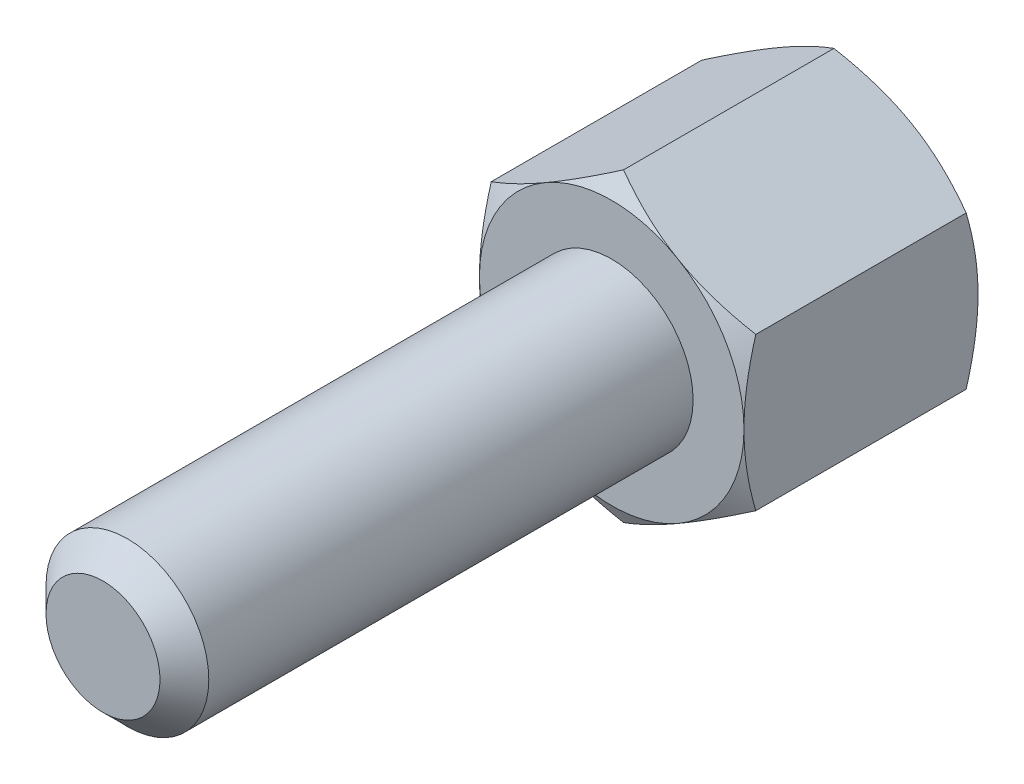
ISO-10303-21;
HEADER;
FILE_DESCRIPTION(('STEP AP214'),'2;1');
FILE_NAME('part.step','',(''),(''),'','','');
FILE_SCHEMA(('AUTOMOTIVE_DESIGN { 1 0 10303 214 1 1 1 1 }'));
ENDSEC;
DATA;
#1=APPLICATION_CONTEXT('core data for automotive mechanical design processes');
#2=APPLICATION_PROTOCOL_DEFINITION('international standard','automotive_design',2000,#1);
#3=PRODUCT_CONTEXT('',#1,'mechanical');
#4=PRODUCT('Part','Part','',(#3));
#5=PRODUCT_RELATED_PRODUCT_CATEGORY('part','',(#4));
#6=PRODUCT_DEFINITION_FORMATION('','',#4);
#7=PRODUCT_DEFINITION_CONTEXT('part definition',#1,'design');
#8=PRODUCT_DEFINITION('design','',#6,#7);
#9=PRODUCT_DEFINITION_SHAPE('','',#8);
#10=(LENGTH_UNIT() NAMED_UNIT(*) SI_UNIT(.MILLI.,.METRE.));
#11=(NAMED_UNIT(*) PLANE_ANGLE_UNIT() SI_UNIT($,.RADIAN.));
#12=(NAMED_UNIT(*) SI_UNIT($,.STERADIAN.) SOLID_ANGLE_UNIT());
#13=UNCERTAINTY_MEASURE_WITH_UNIT(LENGTH_MEASURE(1.E-05),#10,'distance_accuracy_value','');
#14=(GEOMETRIC_REPRESENTATION_CONTEXT(3) GLOBAL_UNCERTAINTY_ASSIGNED_CONTEXT((#13)) GLOBAL_UNIT_ASSIGNED_CONTEXT((#10,
#11,#12)) REPRESENTATION_CONTEXT('',''));
#15=CARTESIAN_POINT('',(0.,0.,0.));
#16=DIRECTION('',(0.,0.,1.));
#17=DIRECTION('',(1.,0.,0.));
#18=AXIS2_PLACEMENT_3D('',#15,#16,#17);
#19=CARTESIAN_POINT('',(0.,-7.50555349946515,28.));
#20=DIRECTION('',(-0.5,-0.866025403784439,0.));
#21=DIRECTION('',(-0.866025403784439,0.5,0.));
#22=AXIS2_PLACEMENT_3D('',#19,#20,#21);
#23=PLANE('',#22);
#24=DIRECTION('',(0.,0.,-1.));
#25=VECTOR('',#24,1.);
#26=CARTESIAN_POINT('',(-6.5,-3.75277674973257,28.));
#27=LINE('',#26,#25);
#28=CARTESIAN_POINT('',(-6.5,-3.75277674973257,12.4194434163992));
#29=VERTEX_POINT('',#28);
#30=CARTESIAN_POINT('',(-6.5,-3.75277674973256,2.08055658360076));
#31=VERTEX_POINT('',#30);
#32=EDGE_CURVE('E134',#29,#31,#27,.T.);
#33=ORIENTED_EDGE('',*,*,#32,.T.);
#34=CARTESIAN_POINT('',(-6.5002,-3.75266127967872,2.08062325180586));
#35=CARTESIAN_POINT('',(-6.35732254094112,-3.8351516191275,2.03300442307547));
#36=CARTESIAN_POINT('',(-6.21391236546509,-3.91794952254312,1.98754670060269));
#37=CARTESIAN_POINT('',(-5.92592736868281,-4.08421773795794,1.90154868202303));
#38=CARTESIAN_POINT('',(-5.78135207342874,-4.16768832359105,1.86101050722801));
#39=CARTESIAN_POINT('',(-5.34531134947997,-4.41943655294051,1.74757100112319));
#40=CARTESIAN_POINT('',(-5.05212471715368,-4.58870793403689,1.68304780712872));
#41=CARTESIAN_POINT('',(-4.61337625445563,-4.84201947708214,1.60738658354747));
#42=CARTESIAN_POINT('',(-4.46912536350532,-4.92530276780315,1.58583285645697));
#43=CARTESIAN_POINT('',(-4.17997178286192,-5.09224566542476,1.5496903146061));
#44=CARTESIAN_POINT('',(-4.03506915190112,-5.17590523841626,1.53510088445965));
#45=CARTESIAN_POINT('',(-3.74501222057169,-5.34336968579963,1.51325875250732));
#46=CARTESIAN_POINT('',(-3.5998583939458,-5.42717428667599,1.50599772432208));
#47=CARTESIAN_POINT('',(-3.30942466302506,-5.59485627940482,1.49896030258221));
#48=CARTESIAN_POINT('',(-3.16414476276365,-5.67873366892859,1.4991836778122));
#49=CARTESIAN_POINT('',(-2.76612405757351,-5.90853103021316,1.51008345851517));
#50=CARTESIAN_POINT('',(-2.51351353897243,-6.05437578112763,1.5283818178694));
#51=CARTESIAN_POINT('',(-2.00997032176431,-6.34509659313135,1.58640634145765));
#52=CARTESIAN_POINT('',(-1.7590393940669,-6.48997163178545,1.62615233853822));
#53=CARTESIAN_POINT('',(-1.25448277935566,-6.78127752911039,1.72550590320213));
#54=CARTESIAN_POINT('',(-1.00092075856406,-6.92767163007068,1.78553442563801));
#55=CARTESIAN_POINT('',(-0.497578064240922,-7.21827667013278,1.92177499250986));
#56=CARTESIAN_POINT('',(-0.247790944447,-7.3624913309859,1.99795503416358));
#57=CARTESIAN_POINT('',(0.000200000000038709,-7.50566896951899,2.08062325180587));
#58=B_SPLINE_CURVE_WITH_KNOTS('',3,(#34,#35,#36,#37,#38,#39,#40,#41,#42,#43,#44,#45,#46,#47,#48,
#49,#50,#51,#52,#53,#54,#55,#56,#57),.UNSPECIFIED.,.F.,.F.,(4,2,2,2,2,2,2,2,2,2,2,4),(0.,
0.515105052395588,1.03043143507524,2.06322554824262,2.56697389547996,3.07067772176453,
3.57380860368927,4.0769239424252,4.95279354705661,5.82947446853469,6.7255991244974,
7.61996451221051),.UNSPECIFIED.);
#59=CARTESIAN_POINT('',(-3.25,-5.62916512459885,1.5));
#60=VERTEX_POINT('',#59);
#61=EDGE_CURVE('E113',#31,#60,#58,.T.);
#62=ORIENTED_EDGE('',*,*,#61,.T.);
#63=CARTESIAN_POINT('',(0.,-7.50555349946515,2.08055658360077));
#64=VERTEX_POINT('',#63);
#65=EDGE_CURVE('E124',#60,#64,#58,.T.);
#66=ORIENTED_EDGE('',*,*,#65,.T.);
#67=DIRECTION('',(0.,0.,-1.));
#68=VECTOR('',#67,1.);
#69=CARTESIAN_POINT('',(0.,-7.50555349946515,28.));
#70=LINE('',#69,#68);
#71=CARTESIAN_POINT('',(0.,-7.50555349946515,12.4194434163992));
#72=VERTEX_POINT('',#71);
#73=EDGE_CURVE('E312',#72,#64,#70,.T.);
#74=ORIENTED_EDGE('',*,*,#73,.F.);
#75=CARTESIAN_POINT('',(0.000200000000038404,-7.50566896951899,12.4193767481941));
#76=CARTESIAN_POINT('',(-0.142677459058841,-7.42317863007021,12.4669955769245));
#77=CARTESIAN_POINT('',(-0.286087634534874,-7.34038072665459,12.5124532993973));
#78=CARTESIAN_POINT('',(-0.574072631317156,-7.17411251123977,12.5984513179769));
#79=CARTESIAN_POINT('',(-0.718647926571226,-7.09064192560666,12.638989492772));
#80=CARTESIAN_POINT('',(-1.15468865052,-6.8388936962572,12.7524289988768));
#81=CARTESIAN_POINT('',(-1.44787528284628,-6.66962231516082,12.8169521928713));
#82=CARTESIAN_POINT('',(-1.88662374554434,-6.41631077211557,12.8926134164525));
#83=CARTESIAN_POINT('',(-2.03087463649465,-6.33302748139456,12.914167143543));
#84=CARTESIAN_POINT('',(-2.32002821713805,-6.16608458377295,12.9503096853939));
#85=CARTESIAN_POINT('',(-2.46493084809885,-6.08242501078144,12.9648991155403));
#86=CARTESIAN_POINT('',(-2.75498777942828,-5.91496056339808,12.9867412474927));
#87=CARTESIAN_POINT('',(-2.90014160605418,-5.83115596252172,12.9940022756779));
#88=CARTESIAN_POINT('',(-3.19057533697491,-5.66347396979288,13.0010396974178));
#89=CARTESIAN_POINT('',(-3.33585523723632,-5.57959658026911,13.0008163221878));
#90=CARTESIAN_POINT('',(-3.73387594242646,-5.34979921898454,12.9899165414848));
#91=CARTESIAN_POINT('',(-3.98648646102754,-5.20395446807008,12.9716181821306));
#92=CARTESIAN_POINT('',(-4.49002967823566,-4.91323365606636,12.9135936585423));
#93=CARTESIAN_POINT('',(-4.74096060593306,-4.76835861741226,12.8738476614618));
#94=CARTESIAN_POINT('',(-5.24551722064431,-4.47705272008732,12.7744940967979));
#95=CARTESIAN_POINT('',(-5.4990792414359,-4.33065861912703,12.714465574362));
#96=CARTESIAN_POINT('',(-6.00242193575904,-4.04005357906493,12.5782250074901));
#97=CARTESIAN_POINT('',(-6.25220905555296,-3.89583891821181,12.5020449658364));
#98=CARTESIAN_POINT('',(-6.5002,-3.75266127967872,12.4193767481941));
#99=B_SPLINE_CURVE_WITH_KNOTS('',3,(#75,#76,#77,#78,#79,#80,#81,#82,#83,#84,#85,#86,#87,#88,#89,
#90,#91,#92,#93,#94,#95,#96,#97,#98),.UNSPECIFIED.,.F.,.F.,(4,2,2,2,2,2,2,2,2,2,2,4),(0.,
0.515105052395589,1.03043143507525,2.06322554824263,2.56697389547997,3.07067772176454,
3.57380860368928,4.07692394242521,4.95279354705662,5.82947446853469,6.7255991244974,
7.6199645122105),.UNSPECIFIED.);
#100=CARTESIAN_POINT('',(-3.25,-5.62916512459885,13.));
#101=VERTEX_POINT('',#100);
#102=EDGE_CURVE('E310',#72,#101,#99,.T.);
#103=ORIENTED_EDGE('',*,*,#102,.T.);
#104=EDGE_CURVE('E199',#101,#29,#99,.T.);
#105=ORIENTED_EDGE('',*,*,#104,.T.);
#106=EDGE_LOOP('',(#33,#62,#66,#74,#103,#105));
#107=FACE_BOUND('',#106,.T.);
#108=ADVANCED_FACE('F14',(#107),#23,.T.);
#109=CARTESIAN_POINT('',(-6.5,-3.75277674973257,28.));
#110=DIRECTION('',(-1.,0.,0.));
#111=DIRECTION('',(0.,0.,-1.));
#112=AXIS2_PLACEMENT_3D('',#109,#110,#111);
#113=PLANE('',#112);
#114=DIRECTION('',(0.,0.,-1.));
#115=VECTOR('',#114,1.);
#116=CARTESIAN_POINT('',(-6.5,3.75277674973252,28.));
#117=LINE('',#116,#115);
#118=CARTESIAN_POINT('',(-6.5,3.75277674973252,12.4194434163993));
#119=VERTEX_POINT('',#118);
#120=CARTESIAN_POINT('',(-6.5,3.75277674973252,2.08055658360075));
#121=VERTEX_POINT('',#120);
#122=EDGE_CURVE('E270',#119,#121,#117,.T.);
#123=ORIENTED_EDGE('',*,*,#122,.T.);
#124=CARTESIAN_POINT('',(-6.5,-10.0361922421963,4.650728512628));
#125=CARTESIAN_POINT('',(-6.5,-9.75266664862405,4.5133716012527));
#126=CARTESIAN_POINT('',(-6.5,-9.46848543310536,4.37734457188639));
#127=CARTESIAN_POINT('',(-6.5,-8.89846294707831,4.10869911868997));
#128=CARTESIAN_POINT('',(-6.5,-8.61262141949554,3.9760812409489));
#129=CARTESIAN_POINT('',(-6.5,-8.03743537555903,3.71432621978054));
#130=CARTESIAN_POINT('',(-6.5,-7.74808023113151,3.58521234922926));
#131=CARTESIAN_POINT('',(-6.5,-7.16705299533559,3.33232770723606));
#132=CARTESIAN_POINT('',(-6.5,-6.87538101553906,3.20855668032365));
#133=CARTESIAN_POINT('',(-6.5,-6.28000501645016,2.96396920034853));
#134=CARTESIAN_POINT('',(-6.5,-5.97621164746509,2.84336904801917));
#135=CARTESIAN_POINT('',(-6.5,-5.36505409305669,2.61140389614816));
#136=CARTESIAN_POINT('',(-6.5,-5.05768950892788,2.50003993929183));
#137=CARTESIAN_POINT('',(-6.5,-4.43949152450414,2.28950289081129));
#138=CARTESIAN_POINT('',(-6.5,-4.12866674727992,2.19030473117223));
#139=CARTESIAN_POINT('',(-6.5,-3.50255570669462,2.00731276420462));
#140=CARTESIAN_POINT('',(-6.5,-3.18727089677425,1.92351405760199));
#141=CARTESIAN_POINT('',(-6.5,-2.55382259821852,1.77581211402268));
#142=CARTESIAN_POINT('',(-6.5,-2.23568434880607,1.71180237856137));
#143=CARTESIAN_POINT('',(-6.5,-1.59545346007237,1.60734042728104));
#144=CARTESIAN_POINT('',(-6.5,-1.27336118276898,1.56688607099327));
#145=CARTESIAN_POINT('',(-6.5,-0.790676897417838,1.52655838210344));
#146=CARTESIAN_POINT('',(-6.5,-0.630894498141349,1.51650896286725));
#147=CARTESIAN_POINT('',(-6.5,-0.311040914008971,1.50316715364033));
#148=CARTESIAN_POINT('',(-6.5,-0.150969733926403,1.49987465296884));
#149=CARTESIAN_POINT('',(-6.5,0.169166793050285,1.50013270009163));
#150=CARTESIAN_POINT('',(-6.5,0.329232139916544,1.50368327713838));
#151=CARTESIAN_POINT('',(-6.5,0.649072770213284,1.51753943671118));
#152=CARTESIAN_POINT('',(-6.5,0.808848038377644,1.52784536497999));
#153=CARTESIAN_POINT('',(-6.5,1.19419727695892,1.56063200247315));
#154=CARTESIAN_POINT('',(-6.5,1.41949778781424,1.58639368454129));
#155=CARTESIAN_POINT('',(-6.5,1.86838679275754,1.64993426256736));
#156=CARTESIAN_POINT('',(-6.5,2.09197504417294,1.6877148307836));
#157=CARTESIAN_POINT('',(-6.5,2.75993879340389,1.81707817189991));
#158=CARTESIAN_POINT('',(-6.5,3.20125496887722,1.92465773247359));
#159=CARTESIAN_POINT('',(-6.5,3.86106261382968,2.11070306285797));
#160=CARTESIAN_POINT('',(-6.5,4.08298948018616,2.17768170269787));
#161=CARTESIAN_POINT('',(-6.5,4.5246869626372,2.31847007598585));
#162=CARTESIAN_POINT('',(-6.5,4.74445756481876,2.39227985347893));
#163=CARTESIAN_POINT('',(-6.5,5.18191389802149,2.54555675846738));
#164=CARTESIAN_POINT('',(-6.5,5.39960031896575,2.62502193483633));
#165=CARTESIAN_POINT('',(-6.5,5.83317828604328,2.78868722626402));
#166=CARTESIAN_POINT('',(-6.5,6.0490698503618,2.87288729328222));
#167=CARTESIAN_POINT('',(-6.5,6.54655902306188,3.07219706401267));
#168=CARTESIAN_POINT('',(-6.5,6.82758289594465,3.18873592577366));
#169=CARTESIAN_POINT('',(-6.5,7.3873338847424,3.42721915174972));
#170=CARTESIAN_POINT('',(-6.5,7.66606087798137,3.54916380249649));
#171=CARTESIAN_POINT('',(-6.5,8.22162486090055,3.79740709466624));
#172=CARTESIAN_POINT('',(-6.5,8.49846149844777,3.92370652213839));
#173=CARTESIAN_POINT('',(-6.5,9.05050907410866,4.17981565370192));
#174=CARTESIAN_POINT('',(-6.5,9.3257199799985,4.30962542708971));
#175=CARTESIAN_POINT('',(-6.5,9.87502028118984,4.57223340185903));
#176=CARTESIAN_POINT('',(-6.5,10.1491084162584,4.70503423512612));
#177=CARTESIAN_POINT('',(-6.5,10.6961211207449,4.97301305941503));
#178=CARTESIAN_POINT('',(-6.5,10.9690456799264,5.10819107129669));
#179=CARTESIAN_POINT('',(-6.5,11.786356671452,5.51668148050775));
#180=CARTESIAN_POINT('',(-6.5,12.3292689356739,5.7929447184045));
#181=CARTESIAN_POINT('',(-6.5,13.1197211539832,6.20032275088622));
#182=CARTESIAN_POINT('',(-6.5,13.3684032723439,6.32923529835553));
#183=CARTESIAN_POINT('',(-6.5,13.8652243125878,6.58809339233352));
#184=CARTESIAN_POINT('',(-6.5,14.1133632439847,6.71803892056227));
#185=CARTESIAN_POINT('',(-6.5,14.8570932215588,7.10922732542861));
#186=CARTESIAN_POINT('',(-6.5,15.3519783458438,7.37181214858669));
#187=CARTESIAN_POINT('',(-6.5,16.3391332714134,7.89910653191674));
#188=CARTESIAN_POINT('',(-6.5,16.8314064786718,8.1638097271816));
#189=CARTESIAN_POINT('',(-6.5,17.814752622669,8.69537673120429));
#190=CARTESIAN_POINT('',(-6.5,18.3058256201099,8.96224042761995));
#191=CARTESIAN_POINT('',(-6.5,18.7964531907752,9.22991533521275));
#192=B_SPLINE_CURVE_WITH_KNOTS('',3,(#124,#125,#126,#127,#128,#129,#130,#131,#132,#133,#134,
#135,#136,#137,#138,#139,#140,#141,#142,#143,#144,#145,#146,#147,#148,#149,#150,#151,#152,#153,
#154,#155,#156,#157,#158,#159,#160,#161,#162,#163,#164,#165,#166,#167,#168,#169,#170,#171,#172,
#173,#174,#175,#176,#177,#178,#179,#180,#181,#182,#183,#184,#185,#186,#187,#188,#189,#190,#191),
.UNSPECIFIED.,.F.,.F.,(4,2,2,2,2,2,2,2,2,2,2,2,2,2,2,2,2,2,2,2,2,2,2,2,2,2,2,2,2,2,2,2,2,4),(0.,
0.945148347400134,1.89044716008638,2.8409675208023,3.79144238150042,4.77189429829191,
5.75245674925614,6.73096350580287,7.7091584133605,8.68199344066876,9.65474005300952,
10.1349132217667,10.6150785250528,11.0952458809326,11.575437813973,12.2553584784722,
12.9353737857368,14.2961794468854,14.991564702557,15.6869544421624,16.3821054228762,
17.077249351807,17.9898636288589,18.9025263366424,19.815354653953,20.7282010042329,
21.6418846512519,22.5555763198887,24.3829978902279,25.2233250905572,26.0636374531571,
27.7443266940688,29.421105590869,31.0977978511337),.UNSPECIFIED.);
#193=CARTESIAN_POINT('',(-6.5,0.,1.5));
#194=VERTEX_POINT('',#193);
#195=EDGE_CURVE('E253',#121,#194,#192,.F.);
#196=ORIENTED_EDGE('',*,*,#195,.T.);
#197=EDGE_CURVE('E115',#194,#31,#192,.F.);
#198=ORIENTED_EDGE('',*,*,#197,.T.);
#199=ORIENTED_EDGE('',*,*,#32,.F.);
#200=CARTESIAN_POINT('',(-6.5,-10.0361922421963,9.84927148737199));
#201=CARTESIAN_POINT('',(-6.5,-9.75266664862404,9.98662839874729));
#202=CARTESIAN_POINT('',(-6.5,-9.46848543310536,10.1226554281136));
#203=CARTESIAN_POINT('',(-6.5,-8.89846294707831,10.39130088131));
#204=CARTESIAN_POINT('',(-6.5,-8.61262141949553,10.5239187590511));
#205=CARTESIAN_POINT('',(-6.5,-8.03743537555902,10.7856737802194));
#206=CARTESIAN_POINT('',(-6.5,-7.7480802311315,10.9147876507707));
#207=CARTESIAN_POINT('',(-6.5,-7.16705299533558,11.1676722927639));
#208=CARTESIAN_POINT('',(-6.5,-6.87538101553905,11.2914433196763));
#209=CARTESIAN_POINT('',(-6.5,-6.28000501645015,11.5360307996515));
#210=CARTESIAN_POINT('',(-6.5,-5.97621164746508,11.6566309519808));
#211=CARTESIAN_POINT('',(-6.5,-5.36505409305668,11.8885961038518));
#212=CARTESIAN_POINT('',(-6.5,-5.05768950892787,11.9999600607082));
#213=CARTESIAN_POINT('',(-6.5,-4.43949152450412,12.2104971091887));
#214=CARTESIAN_POINT('',(-6.5,-4.1286667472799,12.3096952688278));
#215=CARTESIAN_POINT('',(-6.5,-3.50255570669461,12.4926872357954));
#216=CARTESIAN_POINT('',(-6.5,-3.18727089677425,12.576485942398));
#217=CARTESIAN_POINT('',(-6.5,-2.55382259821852,12.7241878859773));
#218=CARTESIAN_POINT('',(-6.5,-2.23568434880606,12.7881976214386));
#219=CARTESIAN_POINT('',(-6.5,-1.59545346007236,12.8926595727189));
#220=CARTESIAN_POINT('',(-6.5,-1.27336118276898,12.9331139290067));
#221=CARTESIAN_POINT('',(-6.5,-0.790676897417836,12.9734416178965));
#222=CARTESIAN_POINT('',(-6.5,-0.630894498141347,12.9834910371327));
#223=CARTESIAN_POINT('',(-6.5,-0.311040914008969,12.9968328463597));
#224=CARTESIAN_POINT('',(-6.5,-0.1509697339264,13.0001253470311));
#225=CARTESIAN_POINT('',(-6.5,0.169166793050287,12.9998672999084));
#226=CARTESIAN_POINT('',(-6.5,0.329232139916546,12.9963167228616));
#227=CARTESIAN_POINT('',(-6.5,0.649072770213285,12.9824605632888));
#228=CARTESIAN_POINT('',(-6.5,0.808848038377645,12.97215463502));
#229=CARTESIAN_POINT('',(-6.5,1.19419727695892,12.9393679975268));
#230=CARTESIAN_POINT('',(-6.5,1.41949778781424,12.9136063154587));
#231=CARTESIAN_POINT('',(-6.5,1.86838679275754,12.8500657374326));
#232=CARTESIAN_POINT('',(-6.5,2.09197504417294,12.8122851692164));
#233=CARTESIAN_POINT('',(-6.5,2.75993879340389,12.6829218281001));
#234=CARTESIAN_POINT('',(-6.5,3.20125496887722,12.5753422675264));
#235=CARTESIAN_POINT('',(-6.5,3.86106261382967,12.389296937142));
#236=CARTESIAN_POINT('',(-6.5,4.08298948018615,12.3223182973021));
#237=CARTESIAN_POINT('',(-6.5,4.52468696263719,12.1815299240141));
#238=CARTESIAN_POINT('',(-6.5,4.74445756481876,12.1077201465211));
#239=CARTESIAN_POINT('',(-6.5,5.18191389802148,11.9544432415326));
#240=CARTESIAN_POINT('',(-6.5,5.39960031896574,11.8749780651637));
#241=CARTESIAN_POINT('',(-6.5,5.83317828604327,11.711312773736));
#242=CARTESIAN_POINT('',(-6.5,6.04906985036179,11.6271127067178));
#243=CARTESIAN_POINT('',(-6.5,6.54655902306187,11.4278029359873));
#244=CARTESIAN_POINT('',(-6.5,6.82758289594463,11.3112640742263));
#245=CARTESIAN_POINT('',(-6.5,7.38733388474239,11.0727808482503));
#246=CARTESIAN_POINT('',(-6.5,7.66606087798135,10.9508361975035));
#247=CARTESIAN_POINT('',(-6.5,8.22162486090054,10.7025929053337));
#248=CARTESIAN_POINT('',(-6.5,8.49846149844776,10.5762934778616));
#249=CARTESIAN_POINT('',(-6.5,9.05050907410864,10.3201843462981));
#250=CARTESIAN_POINT('',(-6.5,9.32571997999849,10.1903745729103));
#251=CARTESIAN_POINT('',(-6.5,9.87502028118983,9.92776659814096));
#252=CARTESIAN_POINT('',(-6.5,10.1491084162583,9.79496576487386));
#253=CARTESIAN_POINT('',(-6.5,10.6961211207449,9.52698694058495));
#254=CARTESIAN_POINT('',(-6.5,10.9690456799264,9.39180892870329));
#255=CARTESIAN_POINT('',(-6.5,11.786356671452,8.98331851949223));
#256=CARTESIAN_POINT('',(-6.5,12.3292689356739,8.70705528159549));
#257=CARTESIAN_POINT('',(-6.5,13.1197211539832,8.29967724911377));
#258=CARTESIAN_POINT('',(-6.5,13.3684032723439,8.17076470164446));
#259=CARTESIAN_POINT('',(-6.5,13.8652243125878,7.91190660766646));
#260=CARTESIAN_POINT('',(-6.5,14.1133632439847,7.78196107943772));
#261=CARTESIAN_POINT('',(-6.5,14.8570932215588,7.39077267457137));
#262=CARTESIAN_POINT('',(-6.5,15.3519783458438,7.1281878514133));
#263=CARTESIAN_POINT('',(-6.5,16.3391332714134,6.60089346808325));
#264=CARTESIAN_POINT('',(-6.5,16.8314064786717,6.33619027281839));
#265=CARTESIAN_POINT('',(-6.5,17.814752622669,5.8046232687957));
#266=CARTESIAN_POINT('',(-6.5,18.3058256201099,5.53775957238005));
#267=CARTESIAN_POINT('',(-6.5,18.7964531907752,5.27008466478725));
#268=B_SPLINE_CURVE_WITH_KNOTS('',3,(#200,#201,#202,#203,#204,#205,#206,#207,#208,#209,#210,
#211,#212,#213,#214,#215,#216,#217,#218,#219,#220,#221,#222,#223,#224,#225,#226,#227,#228,#229,
#230,#231,#232,#233,#234,#235,#236,#237,#238,#239,#240,#241,#242,#243,#244,#245,#246,#247,#248,
#249,#250,#251,#252,#253,#254,#255,#256,#257,#258,#259,#260,#261,#262,#263,#264,#265,#266,#267),
.UNSPECIFIED.,.F.,.F.,(4,2,2,2,2,2,2,2,2,2,2,2,2,2,2,2,2,2,2,2,2,2,2,2,2,2,2,2,2,2,2,2,2,4),(0.,
0.945148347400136,1.89044716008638,2.8409675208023,3.79144238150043,4.77189429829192,
5.75245674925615,6.73096350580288,7.70915841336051,8.68199344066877,9.65474005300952,
10.1349132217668,10.6150785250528,11.0952458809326,11.575437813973,12.2553584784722,
12.9353737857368,14.2961794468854,14.991564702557,15.6869544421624,16.3821054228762,
17.0772493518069,17.9898636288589,18.9025263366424,19.815354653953,20.7282010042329,
21.6418846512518,22.5555763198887,24.3829978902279,25.2233250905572,26.0636374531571,
27.7443266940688,29.421105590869,31.0977978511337),.UNSPECIFIED.);
#269=CARTESIAN_POINT('',(-6.5,0.,13.));
#270=VERTEX_POINT('',#269);
#271=EDGE_CURVE('E209',#29,#270,#268,.T.);
#272=ORIENTED_EDGE('',*,*,#271,.T.);
#273=EDGE_CURVE('E229',#270,#119,#268,.T.);
#274=ORIENTED_EDGE('',*,*,#273,.T.);
#275=EDGE_LOOP('',(#123,#196,#198,#199,#272,#274));
#276=FACE_BOUND('',#275,.T.);
#277=ADVANCED_FACE('F233',(#276),#113,.T.);
#278=CARTESIAN_POINT('',(0.,7.50555349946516,28.));
#279=DIRECTION('',(0.500000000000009,-0.866025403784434,0.));
#280=DIRECTION('',(-0.866025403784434,-0.500000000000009,0.));
#281=AXIS2_PLACEMENT_3D('',#278,#279,#280);
#282=PLANE('',#281);
#283=CARTESIAN_POINT('',(-6.5002,3.75266127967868,2.08062325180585));
#284=CARTESIAN_POINT('',(-6.35732254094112,3.83515161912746,2.03300442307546));
#285=CARTESIAN_POINT('',(-6.21391236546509,3.91794952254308,1.98754670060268));
#286=CARTESIAN_POINT('',(-5.92592736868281,4.08421773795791,1.90154868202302));
#287=CARTESIAN_POINT('',(-5.78135207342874,4.16768832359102,1.861010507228));
#288=CARTESIAN_POINT('',(-5.34531134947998,4.41943655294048,1.74757100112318));
#289=CARTESIAN_POINT('',(-5.05212471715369,4.58870793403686,1.68304780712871));
#290=CARTESIAN_POINT('',(-4.61337625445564,4.84201947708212,1.60738658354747));
#291=CARTESIAN_POINT('',(-4.46912536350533,4.92530276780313,1.58583285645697));
#292=CARTESIAN_POINT('',(-4.17997178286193,5.09224566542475,1.5496903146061));
#293=CARTESIAN_POINT('',(-4.03506915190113,5.17590523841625,1.53510088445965));
#294=CARTESIAN_POINT('',(-3.7450122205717,5.34336968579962,1.51325875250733));
#295=CARTESIAN_POINT('',(-3.59985839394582,5.42717428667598,1.50599772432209));
#296=CARTESIAN_POINT('',(-3.30942466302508,5.59485627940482,1.49896030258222));
#297=CARTESIAN_POINT('',(-3.16414476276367,5.67873366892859,1.4991836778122));
#298=CARTESIAN_POINT('',(-2.76612405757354,5.90853103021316,1.51008345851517));
#299=CARTESIAN_POINT('',(-2.51351353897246,6.05437578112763,1.5283818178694));
#300=CARTESIAN_POINT('',(-2.00997032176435,6.34509659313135,1.58640634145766));
#301=CARTESIAN_POINT('',(-1.75903939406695,6.48997163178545,1.62615233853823));
#302=CARTESIAN_POINT('',(-1.25448277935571,6.7812775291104,1.72550590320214));
#303=CARTESIAN_POINT('',(-1.00092075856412,6.92767163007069,1.78553442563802));
#304=CARTESIAN_POINT('',(-0.497578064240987,7.21827667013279,1.92177499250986));
#305=CARTESIAN_POINT('',(-0.247790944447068,7.36249133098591,1.99795503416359));
#306=CARTESIAN_POINT('',(0.000199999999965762,7.505668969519,2.08062325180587));
#307=B_SPLINE_CURVE_WITH_KNOTS('',3,(#283,#284,#285,#286,#287,#288,#289,#290,#291,#292,#293,
#294,#295,#296,#297,#298,#299,#300,#301,#302,#303,#304,#305,#306),.UNSPECIFIED.,.F.,.F.,(4,2,2,
2,2,2,2,2,2,2,2,4),(0.,0.515105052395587,1.03043143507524,2.06322554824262,2.56697389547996,
3.07067772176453,3.57380860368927,4.07692394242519,4.9527935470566,5.82947446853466,
6.72559912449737,7.61996451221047),.UNSPECIFIED.);
#308=CARTESIAN_POINT('',(-3.25000000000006,5.62916512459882,1.5));
#309=VERTEX_POINT('',#308);
#310=EDGE_CURVE('E244',#121,#309,#307,.T.);
#311=ORIENTED_EDGE('',*,*,#310,.F.);
#312=ORIENTED_EDGE('',*,*,#122,.F.);
#313=CARTESIAN_POINT('',(0.000199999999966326,7.505668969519,12.4193767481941));
#314=CARTESIAN_POINT('',(-0.142677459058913,7.42317863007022,12.4669955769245));
#315=CARTESIAN_POINT('',(-0.286087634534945,7.3403807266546,12.5124532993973));
#316=CARTESIAN_POINT('',(-0.574072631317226,7.17411251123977,12.5984513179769));
#317=CARTESIAN_POINT('',(-0.718647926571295,7.09064192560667,12.638989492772));
#318=CARTESIAN_POINT('',(-1.15468865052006,6.8388936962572,12.7524289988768));
#319=CARTESIAN_POINT('',(-1.44787528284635,6.66962231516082,12.8169521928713));
#320=CARTESIAN_POINT('',(-1.8866237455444,6.41631077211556,12.8926134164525));
#321=CARTESIAN_POINT('',(-2.03087463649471,6.33302748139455,12.914167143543));
#322=CARTESIAN_POINT('',(-2.32002821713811,6.16608458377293,12.9503096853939));
#323=CARTESIAN_POINT('',(-2.46493084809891,6.08242501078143,12.9648991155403));
#324=CARTESIAN_POINT('',(-2.75498777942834,5.91496056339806,12.9867412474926));
#325=CARTESIAN_POINT('',(-2.90014160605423,5.8311559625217,12.9940022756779));
#326=CARTESIAN_POINT('',(-3.19057533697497,5.66347396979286,13.0010396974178));
#327=CARTESIAN_POINT('',(-3.33585523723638,5.57959658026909,13.0008163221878));
#328=CARTESIAN_POINT('',(-3.73387594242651,5.34979921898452,12.9899165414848));
#329=CARTESIAN_POINT('',(-3.98648646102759,5.20395446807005,12.9716181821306));
#330=CARTESIAN_POINT('',(-4.49002967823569,4.91323365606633,12.9135936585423));
#331=CARTESIAN_POINT('',(-4.74096060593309,4.76835861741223,12.8738476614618));
#332=CARTESIAN_POINT('',(-5.24551722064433,4.47705272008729,12.7744940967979));
#333=CARTESIAN_POINT('',(-5.49907924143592,4.33065861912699,12.714465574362));
#334=CARTESIAN_POINT('',(-6.00242193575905,4.0400535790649,12.5782250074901));
#335=CARTESIAN_POINT('',(-6.25220905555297,3.89583891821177,12.5020449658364));
#336=CARTESIAN_POINT('',(-6.5002,3.75266127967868,12.4193767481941));
#337=B_SPLINE_CURVE_WITH_KNOTS('',3,(#313,#314,#315,#316,#317,#318,#319,#320,#321,#322,#323,
#324,#325,#326,#327,#328,#329,#330,#331,#332,#333,#334,#335,#336),.UNSPECIFIED.,.F.,.F.,(4,2,2,
2,2,2,2,2,2,2,2,4),(0.,0.515105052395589,1.03043143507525,2.06322554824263,2.56697389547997,
3.07067772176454,3.57380860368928,4.07692394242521,4.95279354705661,5.82947446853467,
6.72559912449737,7.61996451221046),.UNSPECIFIED.);
#338=CARTESIAN_POINT('',(-3.25000000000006,5.62916512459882,13.));
#339=VERTEX_POINT('',#338);
#340=EDGE_CURVE('E223',#339,#119,#337,.T.);
#341=ORIENTED_EDGE('',*,*,#340,.F.);
#342=CARTESIAN_POINT('',(0.,7.50555349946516,12.4194434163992));
#343=VERTEX_POINT('',#342);
#344=EDGE_CURVE('E228',#343,#339,#337,.T.);
#345=ORIENTED_EDGE('',*,*,#344,.F.);
#346=DIRECTION('',(0.,0.,-1.));
#347=VECTOR('',#346,1.);
#348=CARTESIAN_POINT('',(0.,7.50555349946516,28.));
#349=LINE('',#348,#347);
#350=CARTESIAN_POINT('',(0.,7.50555349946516,2.08055658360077));
#351=VERTEX_POINT('',#350);
#352=EDGE_CURVE('E278',#343,#351,#349,.T.);
#353=ORIENTED_EDGE('',*,*,#352,.T.);
#354=EDGE_CURVE('E238',#309,#351,#307,.T.);
#355=ORIENTED_EDGE('',*,*,#354,.F.);
#356=EDGE_LOOP('',(#311,#312,#341,#345,#353,#355));
#357=FACE_BOUND('',#356,.T.);
#358=ADVANCED_FACE('F230',(#357),#282,.F.);
#359=CARTESIAN_POINT('',(0.,7.50555349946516,28.));
#360=DIRECTION('',(0.5,0.866025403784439,0.));
#361=DIRECTION('',(0.866025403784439,-0.5,0.));
#362=AXIS2_PLACEMENT_3D('',#359,#360,#361);
#363=PLANE('',#362);
#364=DIRECTION('',(0.,0.,-1.));
#365=VECTOR('',#364,1.);
#366=CARTESIAN_POINT('',(6.5,3.75277674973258,28.));
#367=LINE('',#366,#365);
#368=CARTESIAN_POINT('',(6.5,3.75277674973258,12.4194434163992));
#369=VERTEX_POINT('',#368);
#370=CARTESIAN_POINT('',(6.5,3.75277674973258,2.08055658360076));
#371=VERTEX_POINT('',#370);
#372=EDGE_CURVE('E290',#369,#371,#367,.T.);
#373=ORIENTED_EDGE('',*,*,#372,.T.);
#374=CARTESIAN_POINT('',(6.5002,3.75266127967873,2.08062325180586));
#375=CARTESIAN_POINT('',(6.35732254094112,3.83515161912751,2.03300442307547));
#376=CARTESIAN_POINT('',(6.21391236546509,3.91794952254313,1.98754670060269));
#377=CARTESIAN_POINT('',(5.92592736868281,4.08421773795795,1.90154868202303));
#378=CARTESIAN_POINT('',(5.78135207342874,4.16768832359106,1.86101050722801));
#379=CARTESIAN_POINT('',(5.34531134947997,4.41943655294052,1.74757100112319));
#380=CARTESIAN_POINT('',(5.05212471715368,4.5887079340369,1.68304780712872));
#381=CARTESIAN_POINT('',(4.61337625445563,4.84201947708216,1.60738658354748));
#382=CARTESIAN_POINT('',(4.46912536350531,4.92530276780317,1.58583285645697));
#383=CARTESIAN_POINT('',(4.17997178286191,5.09224566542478,1.5496903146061));
#384=CARTESIAN_POINT('',(4.03506915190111,5.17590523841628,1.53510088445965));
#385=CARTESIAN_POINT('',(3.74501222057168,5.34336968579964,1.51325875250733));
#386=CARTESIAN_POINT('',(3.59985839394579,5.427174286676,1.50599772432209));
#387=CARTESIAN_POINT('',(3.30942466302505,5.59485627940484,1.49896030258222));
#388=CARTESIAN_POINT('',(3.16414476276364,5.67873366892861,1.4991836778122));
#389=CARTESIAN_POINT('',(2.7661240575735,5.90853103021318,1.51008345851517));
#390=CARTESIAN_POINT('',(2.51351353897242,6.05437578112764,1.5283818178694));
#391=CARTESIAN_POINT('',(2.00997032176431,6.34509659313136,1.58640634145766));
#392=CARTESIAN_POINT('',(1.7590393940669,6.48997163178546,1.62615233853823));
#393=CARTESIAN_POINT('',(1.25448277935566,6.7812775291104,1.72550590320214));
#394=CARTESIAN_POINT('',(1.00092075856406,6.9276716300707,1.78553442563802));
#395=CARTESIAN_POINT('',(0.497578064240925,7.21827667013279,1.92177499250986));
#396=CARTESIAN_POINT('',(0.247790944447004,7.36249133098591,1.99795503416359));
#397=CARTESIAN_POINT('',(-0.000200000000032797,7.505668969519,2.08062325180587));
#398=B_SPLINE_CURVE_WITH_KNOTS('',3,(#374,#375,#376,#377,#378,#379,#380,#381,#382,#383,#384,
#385,#386,#387,#388,#389,#390,#391,#392,#393,#394,#395,#396,#397),.UNSPECIFIED.,.F.,.F.,(4,2,2,
2,2,2,2,2,2,2,2,4),(0.,0.515105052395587,1.03043143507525,2.06322554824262,2.56697389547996,
3.07067772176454,3.57380860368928,4.0769239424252,4.95279354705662,5.82947446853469,
6.7255991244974,7.6199645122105),.UNSPECIFIED.);
#399=CARTESIAN_POINT('',(3.25,5.62916512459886,1.5));
#400=VERTEX_POINT('',#399);
#401=EDGE_CURVE('E129',#371,#400,#398,.T.);
#402=ORIENTED_EDGE('',*,*,#401,.T.);
#403=EDGE_CURVE('E135',#400,#351,#398,.T.);
#404=ORIENTED_EDGE('',*,*,#403,.T.);
#405=ORIENTED_EDGE('',*,*,#352,.F.);
#406=CARTESIAN_POINT('',(-0.000200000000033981,7.505668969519,12.4193767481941));
#407=CARTESIAN_POINT('',(0.142677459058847,7.42317863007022,12.4669955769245));
#408=CARTESIAN_POINT('',(0.286087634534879,7.3403807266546,12.5124532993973));
#409=CARTESIAN_POINT('',(0.574072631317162,7.17411251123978,12.5984513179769));
#410=CARTESIAN_POINT('',(0.718647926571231,7.09064192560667,12.638989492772));
#411=CARTESIAN_POINT('',(1.15468865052,6.83889369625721,12.7524289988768));
#412=CARTESIAN_POINT('',(1.44787528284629,6.66962231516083,12.8169521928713));
#413=CARTESIAN_POINT('',(1.88662374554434,6.41631077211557,12.8926134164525));
#414=CARTESIAN_POINT('',(2.03087463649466,6.33302748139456,12.914167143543));
#415=CARTESIAN_POINT('',(2.32002821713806,6.16608458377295,12.9503096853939));
#416=CARTESIAN_POINT('',(2.46493084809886,6.08242501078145,12.9648991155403));
#417=CARTESIAN_POINT('',(2.75498777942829,5.91496056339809,12.9867412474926));
#418=CARTESIAN_POINT('',(2.90014160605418,5.83115596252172,12.9940022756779));
#419=CARTESIAN_POINT('',(3.19057533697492,5.66347396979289,13.0010396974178));
#420=CARTESIAN_POINT('',(3.33585523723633,5.57959658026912,13.0008163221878));
#421=CARTESIAN_POINT('',(3.73387594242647,5.34979921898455,12.9899165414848));
#422=CARTESIAN_POINT('',(3.98648646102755,5.20395446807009,12.9716181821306));
#423=CARTESIAN_POINT('',(4.49002967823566,4.91323365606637,12.9135936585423));
#424=CARTESIAN_POINT('',(4.74096060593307,4.76835861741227,12.8738476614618));
#425=CARTESIAN_POINT('',(5.24551722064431,4.47705272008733,12.7744940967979));
#426=CARTESIAN_POINT('',(5.49907924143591,4.33065861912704,12.714465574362));
#427=CARTESIAN_POINT('',(6.00242193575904,4.04005357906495,12.5782250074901));
#428=CARTESIAN_POINT('',(6.25220905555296,3.89583891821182,12.5020449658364));
#429=CARTESIAN_POINT('',(6.5002,3.75266127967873,12.4193767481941));
#430=B_SPLINE_CURVE_WITH_KNOTS('',3,(#406,#407,#408,#409,#410,#411,#412,#413,#414,#415,#416,
#417,#418,#419,#420,#421,#422,#423,#424,#425,#426,#427,#428,#429),.UNSPECIFIED.,.F.,.F.,(4,2,2,
2,2,2,2,2,2,2,2,4),(0.,0.515105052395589,1.03043143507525,2.06322554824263,2.56697389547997,
3.07067772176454,3.57380860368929,4.07692394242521,4.95279354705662,5.82947446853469,
6.72559912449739,7.61996451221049),.UNSPECIFIED.);
#431=CARTESIAN_POINT('',(3.25,5.62916512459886,13.));
#432=VERTEX_POINT('',#431);
#433=EDGE_CURVE('E179',#343,#432,#430,.T.);
#434=ORIENTED_EDGE('',*,*,#433,.T.);
#435=EDGE_CURVE('E178',#432,#369,#430,.T.);
#436=ORIENTED_EDGE('',*,*,#435,.T.);
#437=EDGE_LOOP('',(#373,#402,#404,#405,#434,#436));
#438=FACE_BOUND('',#437,.T.);
#439=ADVANCED_FACE('F163',(#438),#363,.T.);
#440=CARTESIAN_POINT('',(6.5,-3.75277674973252,28.));
#441=DIRECTION('',(-1.,0.,0.));
#442=DIRECTION('',(0.,0.,-1.));
#443=AXIS2_PLACEMENT_3D('',#440,#441,#442);
#444=PLANE('',#443);
#445=CARTESIAN_POINT('',(6.5,-10.0361922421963,4.65072851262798));
#446=CARTESIAN_POINT('',(6.5,-9.75266664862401,4.51337160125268));
#447=CARTESIAN_POINT('',(6.5,-9.46848543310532,4.37734457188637));
#448=CARTESIAN_POINT('',(6.5,-8.89846294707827,4.10869911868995));
#449=CARTESIAN_POINT('',(6.5,-8.6126214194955,3.97608124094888));
#450=CARTESIAN_POINT('',(6.5,-8.03743537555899,3.71432621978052));
#451=CARTESIAN_POINT('',(6.5,-7.74808023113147,3.58521234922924));
#452=CARTESIAN_POINT('',(6.5,-7.16705299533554,3.33232770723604));
#453=CARTESIAN_POINT('',(6.5,-6.87538101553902,3.20855668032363));
#454=CARTESIAN_POINT('',(6.5,-6.28000501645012,2.96396920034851));
#455=CARTESIAN_POINT('',(6.5,-5.97621164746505,2.84336904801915));
#456=CARTESIAN_POINT('',(6.5,-5.36505409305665,2.61140389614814));
#457=CARTESIAN_POINT('',(6.5,-5.05768950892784,2.50003993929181));
#458=CARTESIAN_POINT('',(6.5,-4.43949152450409,2.28950289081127));
#459=CARTESIAN_POINT('',(6.5,-4.12866674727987,2.19030473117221));
#460=CARTESIAN_POINT('',(6.5,-3.50255570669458,2.00731276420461));
#461=CARTESIAN_POINT('',(6.5,-3.18727089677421,1.92351405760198));
#462=CARTESIAN_POINT('',(6.5,-2.55382259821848,1.77581211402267));
#463=CARTESIAN_POINT('',(6.5,-2.23568434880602,1.71180237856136));
#464=CARTESIAN_POINT('',(6.5,-1.59545346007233,1.60734042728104));
#465=CARTESIAN_POINT('',(6.5,-1.27336118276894,1.56688607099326));
#466=CARTESIAN_POINT('',(6.5,-0.790676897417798,1.52655838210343));
#467=CARTESIAN_POINT('',(6.5,-0.630894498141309,1.51650896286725));
#468=CARTESIAN_POINT('',(6.5,-0.311040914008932,1.50316715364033));
#469=CARTESIAN_POINT('',(6.5,-0.150969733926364,1.49987465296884));
#470=CARTESIAN_POINT('',(6.5,0.169166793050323,1.50013270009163));
#471=CARTESIAN_POINT('',(6.5,0.329232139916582,1.50368327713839));
#472=CARTESIAN_POINT('',(6.5,0.649072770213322,1.51753943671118));
#473=CARTESIAN_POINT('',(6.5,0.808848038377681,1.52784536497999));
#474=CARTESIAN_POINT('',(6.5,1.19419727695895,1.56063200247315));
#475=CARTESIAN_POINT('',(6.5,1.41949778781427,1.58639368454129));
#476=CARTESIAN_POINT('',(6.5,1.86838679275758,1.64993426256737));
#477=CARTESIAN_POINT('',(6.5,2.09197504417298,1.68771483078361));
#478=CARTESIAN_POINT('',(6.5,2.75993879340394,1.81707817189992));
#479=CARTESIAN_POINT('',(6.5,3.20125496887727,1.9246577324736));
#480=CARTESIAN_POINT('',(6.5,3.86106261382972,2.11070306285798));
#481=CARTESIAN_POINT('',(6.5,4.0829894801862,2.17768170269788));
#482=CARTESIAN_POINT('',(6.5,4.52468696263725,2.31847007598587));
#483=CARTESIAN_POINT('',(6.5,4.74445756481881,2.39227985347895));
#484=CARTESIAN_POINT('',(6.5,5.18191389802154,2.5455567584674));
#485=CARTESIAN_POINT('',(6.5,5.3996003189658,2.62502193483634));
#486=CARTESIAN_POINT('',(6.5,5.83317828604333,2.78868722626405));
#487=CARTESIAN_POINT('',(6.5,6.04906985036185,2.87288729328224));
#488=CARTESIAN_POINT('',(6.5,6.54655902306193,3.07219706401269));
#489=CARTESIAN_POINT('',(6.5,6.82758289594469,3.18873592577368));
#490=CARTESIAN_POINT('',(6.5,7.38733388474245,3.42721915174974));
#491=CARTESIAN_POINT('',(6.5,7.66606087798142,3.54916380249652));
#492=CARTESIAN_POINT('',(6.5,8.2216248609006,3.79740709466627));
#493=CARTESIAN_POINT('',(6.5,8.49846149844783,3.92370652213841));
#494=CARTESIAN_POINT('',(6.5,9.05050907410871,4.17981565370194));
#495=CARTESIAN_POINT('',(6.5,9.32571997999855,4.30962542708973));
#496=CARTESIAN_POINT('',(6.5,9.8750202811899,4.57223340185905));
#497=CARTESIAN_POINT('',(6.5,10.1491084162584,4.70503423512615));
#498=CARTESIAN_POINT('',(6.5,10.696121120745,4.97301305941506));
#499=CARTESIAN_POINT('',(6.5,10.9690456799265,5.10819107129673));
#500=CARTESIAN_POINT('',(6.5,11.786356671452,5.51668148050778));
#501=CARTESIAN_POINT('',(6.5,12.3292689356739,5.79294471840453));
#502=CARTESIAN_POINT('',(6.5,13.1197211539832,6.20032275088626));
#503=CARTESIAN_POINT('',(6.5,13.368403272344,6.32923529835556));
#504=CARTESIAN_POINT('',(6.5,13.8652243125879,6.58809339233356));
#505=CARTESIAN_POINT('',(6.5,14.1133632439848,6.71803892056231));
#506=CARTESIAN_POINT('',(6.5,14.8570932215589,7.10922732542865));
#507=CARTESIAN_POINT('',(6.5,15.3519783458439,7.37181214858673));
#508=CARTESIAN_POINT('',(6.5,16.3391332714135,7.89910653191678));
#509=CARTESIAN_POINT('',(6.5,16.8314064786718,8.16380972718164));
#510=CARTESIAN_POINT('',(6.5,17.8147526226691,8.69537673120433));
#511=CARTESIAN_POINT('',(6.5,18.30582562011,8.96224042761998));
#512=CARTESIAN_POINT('',(6.5,18.7964531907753,9.22991533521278));
#513=B_SPLINE_CURVE_WITH_KNOTS('',3,(#445,#446,#447,#448,#449,#450,#451,#452,#453,#454,#455,
#456,#457,#458,#459,#460,#461,#462,#463,#464,#465,#466,#467,#468,#469,#470,#471,#472,#473,#474,
#475,#476,#477,#478,#479,#480,#481,#482,#483,#484,#485,#486,#487,#488,#489,#490,#491,#492,#493,
#494,#495,#496,#497,#498,#499,#500,#501,#502,#503,#504,#505,#506,#507,#508,#509,#510,#511,#512),
.UNSPECIFIED.,.F.,.F.,(4,2,2,2,2,2,2,2,2,2,2,2,2,2,2,2,2,2,2,2,2,2,2,2,2,2,2,2,2,2,2,2,2,4),(0.,
0.945148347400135,1.89044716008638,2.8409675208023,3.79144238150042,4.77189429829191,
5.75245674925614,6.73096350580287,7.7091584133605,8.68199344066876,9.65474005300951,
10.1349132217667,10.6150785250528,11.0952458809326,11.575437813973,12.2553584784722,
12.9353737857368,14.2961794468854,14.991564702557,15.6869544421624,16.3821054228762,
17.077249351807,17.9898636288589,18.9025263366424,19.8153546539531,20.728201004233,
21.6418846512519,22.5555763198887,24.3829978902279,25.2233250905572,26.0636374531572,
27.7443266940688,29.4211055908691,31.0977978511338),.UNSPECIFIED.);
#514=CARTESIAN_POINT('',(6.5,0.,1.5));
#515=VERTEX_POINT('',#514);
#516=EDGE_CURVE('E149',#371,#515,#513,.F.);
#517=ORIENTED_EDGE('',*,*,#516,.F.);
#518=ORIENTED_EDGE('',*,*,#372,.F.);
#519=CARTESIAN_POINT('',(6.5,-10.0361922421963,9.84927148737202));
#520=CARTESIAN_POINT('',(6.5,-9.752666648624,9.98662839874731));
#521=CARTESIAN_POINT('',(6.5,-9.46848543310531,10.1226554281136));
#522=CARTESIAN_POINT('',(6.5,-8.89846294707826,10.39130088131));
#523=CARTESIAN_POINT('',(6.5,-8.61262141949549,10.5239187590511));
#524=CARTESIAN_POINT('',(6.5,-8.03743537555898,10.7856737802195));
#525=CARTESIAN_POINT('',(6.5,-7.74808023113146,10.9147876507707));
#526=CARTESIAN_POINT('',(6.5,-7.16705299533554,11.1676722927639));
#527=CARTESIAN_POINT('',(6.5,-6.87538101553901,11.2914433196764));
#528=CARTESIAN_POINT('',(6.5,-6.28000501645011,11.5360307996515));
#529=CARTESIAN_POINT('',(6.5,-5.97621164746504,11.6566309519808));
#530=CARTESIAN_POINT('',(6.5,-5.36505409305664,11.8885961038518));
#531=CARTESIAN_POINT('',(6.5,-5.05768950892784,11.9999600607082));
#532=CARTESIAN_POINT('',(6.5,-4.43949152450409,12.2104971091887));
#533=CARTESIAN_POINT('',(6.5,-4.12866674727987,12.3096952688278));
#534=CARTESIAN_POINT('',(6.5,-3.50255570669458,12.4926872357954));
#535=CARTESIAN_POINT('',(6.5,-3.18727089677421,12.576485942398));
#536=CARTESIAN_POINT('',(6.5,-2.55382259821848,12.7241878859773));
#537=CARTESIAN_POINT('',(6.5,-2.23568434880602,12.7881976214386));
#538=CARTESIAN_POINT('',(6.5,-1.59545346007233,12.8926595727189));
#539=CARTESIAN_POINT('',(6.5,-1.27336118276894,12.9331139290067));
#540=CARTESIAN_POINT('',(6.5,-0.790676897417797,12.9734416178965));
#541=CARTESIAN_POINT('',(6.5,-0.630894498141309,12.9834910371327));
#542=CARTESIAN_POINT('',(6.5,-0.311040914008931,12.9968328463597));
#543=CARTESIAN_POINT('',(6.5,-0.150969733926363,13.0001253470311));
#544=CARTESIAN_POINT('',(6.5,0.169166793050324,12.9998672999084));
#545=CARTESIAN_POINT('',(6.5,0.329232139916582,12.9963167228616));
#546=CARTESIAN_POINT('',(6.5,0.649072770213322,12.9824605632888));
#547=CARTESIAN_POINT('',(6.5,0.808848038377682,12.97215463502));
#548=CARTESIAN_POINT('',(6.5,1.19419727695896,12.9393679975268));
#549=CARTESIAN_POINT('',(6.5,1.41949778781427,12.9136063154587));
#550=CARTESIAN_POINT('',(6.5,1.86838679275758,12.8500657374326));
#551=CARTESIAN_POINT('',(6.5,2.09197504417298,12.8122851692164));
#552=CARTESIAN_POINT('',(6.5,2.75993879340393,12.6829218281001));
#553=CARTESIAN_POINT('',(6.5,3.20125496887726,12.5753422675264));
#554=CARTESIAN_POINT('',(6.5,3.86106261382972,12.389296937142));
#555=CARTESIAN_POINT('',(6.5,4.0829894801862,12.3223182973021));
#556=CARTESIAN_POINT('',(6.5,4.52468696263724,12.1815299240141));
#557=CARTESIAN_POINT('',(6.5,4.74445756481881,12.107720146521));
#558=CARTESIAN_POINT('',(6.5,5.18191389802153,11.9544432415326));
#559=CARTESIAN_POINT('',(6.5,5.39960031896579,11.8749780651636));
#560=CARTESIAN_POINT('',(6.5,5.83317828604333,11.7113127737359));
#561=CARTESIAN_POINT('',(6.5,6.04906985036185,11.6271127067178));
#562=CARTESIAN_POINT('',(6.5,6.54655902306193,11.4278029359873));
#563=CARTESIAN_POINT('',(6.5,6.82758289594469,11.3112640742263));
#564=CARTESIAN_POINT('',(6.5,7.38733388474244,11.0727808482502));
#565=CARTESIAN_POINT('',(6.5,7.66606087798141,10.9508361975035));
#566=CARTESIAN_POINT('',(6.5,8.22162486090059,10.7025929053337));
#567=CARTESIAN_POINT('',(6.5,8.49846149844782,10.5762934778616));
#568=CARTESIAN_POINT('',(6.5,9.0505090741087,10.320184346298));
#569=CARTESIAN_POINT('',(6.5,9.32571997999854,10.1903745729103));
#570=CARTESIAN_POINT('',(6.5,9.87502028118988,9.92776659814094));
#571=CARTESIAN_POINT('',(6.5,10.1491084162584,9.79496576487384));
#572=CARTESIAN_POINT('',(6.5,10.696121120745,9.52698694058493));
#573=CARTESIAN_POINT('',(6.5,10.9690456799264,9.39180892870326));
#574=CARTESIAN_POINT('',(6.5,11.786356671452,8.98331851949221));
#575=CARTESIAN_POINT('',(6.5,12.3292689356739,8.70705528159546));
#576=CARTESIAN_POINT('',(6.5,13.1197211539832,8.29967724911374));
#577=CARTESIAN_POINT('',(6.5,13.368403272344,8.17076470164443));
#578=CARTESIAN_POINT('',(6.5,13.8652243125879,7.91190660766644));
#579=CARTESIAN_POINT('',(6.5,14.1133632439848,7.78196107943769));
#580=CARTESIAN_POINT('',(6.5,14.8570932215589,7.39077267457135));
#581=CARTESIAN_POINT('',(6.5,15.3519783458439,7.12818785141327));
#582=CARTESIAN_POINT('',(6.5,16.3391332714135,6.60089346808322));
#583=CARTESIAN_POINT('',(6.5,16.8314064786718,6.33619027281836));
#584=CARTESIAN_POINT('',(6.5,17.8147526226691,5.80462326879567));
#585=CARTESIAN_POINT('',(6.5,18.30582562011,5.53775957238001));
#586=CARTESIAN_POINT('',(6.5,18.7964531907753,5.27008466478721));
#587=B_SPLINE_CURVE_WITH_KNOTS('',3,(#519,#520,#521,#522,#523,#524,#525,#526,#527,#528,#529,
#530,#531,#532,#533,#534,#535,#536,#537,#538,#539,#540,#541,#542,#543,#544,#545,#546,#547,#548,
#549,#550,#551,#552,#553,#554,#555,#556,#557,#558,#559,#560,#561,#562,#563,#564,#565,#566,#567,
#568,#569,#570,#571,#572,#573,#574,#575,#576,#577,#578,#579,#580,#581,#582,#583,#584,#585,#586),
.UNSPECIFIED.,.F.,.F.,(4,2,2,2,2,2,2,2,2,2,2,2,2,2,2,2,2,2,2,2,2,2,2,2,2,2,2,2,2,2,2,2,2,4),(0.,
0.945148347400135,1.89044716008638,2.8409675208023,3.79144238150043,4.77189429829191,
5.75245674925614,6.73096350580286,7.7091584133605,8.68199344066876,9.65474005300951,
10.1349132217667,10.6150785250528,11.0952458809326,11.575437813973,12.2553584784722,
12.9353737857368,14.2961794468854,14.991564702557,15.6869544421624,16.3821054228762,
17.077249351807,17.9898636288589,18.9025263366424,19.815354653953,20.7282010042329,
21.6418846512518,22.5555763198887,24.3829978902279,25.2233250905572,26.0636374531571,
27.7443266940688,29.4211055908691,31.0977978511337),.UNSPECIFIED.);
#588=CARTESIAN_POINT('',(6.5,0.,13.));
#589=VERTEX_POINT('',#588);
#590=EDGE_CURVE('E170',#589,#369,#587,.T.);
#591=ORIENTED_EDGE('',*,*,#590,.F.);
#592=CARTESIAN_POINT('',(6.5,-3.75277674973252,12.4194434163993));
#593=VERTEX_POINT('',#592);
#594=EDGE_CURVE('E177',#593,#589,#587,.T.);
#595=ORIENTED_EDGE('',*,*,#594,.F.);
#596=DIRECTION('',(0.,0.,-1.));
#597=VECTOR('',#596,1.);
#598=CARTESIAN_POINT('',(6.5,-3.75277674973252,28.));
#599=LINE('',#598,#597);
#600=CARTESIAN_POINT('',(6.5,-3.75277674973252,2.08055658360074));
#601=VERTEX_POINT('',#600);
#602=EDGE_CURVE('E294',#593,#601,#599,.T.);
#603=ORIENTED_EDGE('',*,*,#602,.T.);
#604=EDGE_CURVE('E142',#515,#601,#513,.F.);
#605=ORIENTED_EDGE('',*,*,#604,.F.);
#606=EDGE_LOOP('',(#517,#518,#591,#595,#603,#605));
#607=FACE_BOUND('',#606,.T.);
#608=ADVANCED_FACE('F158',(#607),#444,.F.);
#609=CARTESIAN_POINT('',(0.,-7.50555349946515,28.));
#610=DIRECTION('',(-0.500000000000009,0.866025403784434,0.));
#611=DIRECTION('',(0.866025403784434,0.500000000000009,0.));
#612=AXIS2_PLACEMENT_3D('',#609,#610,#611);
#613=PLANE('',#612);
#614=CARTESIAN_POINT('',(6.5002,-3.75266127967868,2.08062325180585));
#615=CARTESIAN_POINT('',(6.35732254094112,-3.83515161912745,2.03300442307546));
#616=CARTESIAN_POINT('',(6.21391236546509,-3.91794952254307,1.98754670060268));
#617=CARTESIAN_POINT('',(5.92592736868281,-4.0842177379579,1.90154868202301));
#618=CARTESIAN_POINT('',(5.78135207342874,-4.16768832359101,1.861010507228));
#619=CARTESIAN_POINT('',(5.34531134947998,-4.41943655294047,1.74757100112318));
#620=CARTESIAN_POINT('',(5.0521247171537,-4.58870793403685,1.68304780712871));
#621=CARTESIAN_POINT('',(4.61337625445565,-4.84201947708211,1.60738658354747));
#622=CARTESIAN_POINT('',(4.46912536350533,-4.92530276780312,1.58583285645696));
#623=CARTESIAN_POINT('',(4.17997178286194,-5.09224566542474,1.54969031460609));
#624=CARTESIAN_POINT('',(4.03506915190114,-5.17590523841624,1.53510088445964));
#625=CARTESIAN_POINT('',(3.74501222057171,-5.34336968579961,1.51325875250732));
#626=CARTESIAN_POINT('',(3.59985839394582,-5.42717428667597,1.50599772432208));
#627=CARTESIAN_POINT('',(3.30942466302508,-5.59485627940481,1.49896030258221));
#628=CARTESIAN_POINT('',(3.16414476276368,-5.67873366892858,1.4991836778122));
#629=CARTESIAN_POINT('',(2.76612405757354,-5.90853103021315,1.51008345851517));
#630=CARTESIAN_POINT('',(2.51351353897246,-6.05437578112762,1.5283818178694));
#631=CARTESIAN_POINT('',(2.00997032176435,-6.34509659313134,1.58640634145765));
#632=CARTESIAN_POINT('',(1.75903939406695,-6.48997163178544,1.62615233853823));
#633=CARTESIAN_POINT('',(1.25448277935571,-6.78127752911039,1.72550590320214));
#634=CARTESIAN_POINT('',(1.00092075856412,-6.92767163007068,1.78553442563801));
#635=CARTESIAN_POINT('',(0.49757806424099,-7.21827667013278,1.92177499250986));
#636=CARTESIAN_POINT('',(0.247790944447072,-7.3624913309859,1.99795503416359));
#637=CARTESIAN_POINT('',(-0.000199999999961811,-7.50566896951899,2.08062325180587));
#638=B_SPLINE_CURVE_WITH_KNOTS('',3,(#614,#615,#616,#617,#618,#619,#620,#621,#622,#623,#624,
#625,#626,#627,#628,#629,#630,#631,#632,#633,#634,#635,#636,#637),.UNSPECIFIED.,.F.,.F.,(4,2,2,
2,2,2,2,2,2,2,2,4),(0.,0.515105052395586,1.03043143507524,2.06322554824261,2.56697389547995,
3.07067772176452,3.57380860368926,4.07692394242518,4.95279354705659,5.82947446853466,
6.72559912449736,7.61996451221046),.UNSPECIFIED.);
#639=CARTESIAN_POINT('',(3.25000000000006,-5.62916512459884,1.5));
#640=VERTEX_POINT('',#639);
#641=EDGE_CURVE('E9',#601,#640,#638,.T.);
#642=ORIENTED_EDGE('',*,*,#641,.F.);
#643=ORIENTED_EDGE('',*,*,#602,.F.);
#644=CARTESIAN_POINT('',(-0.000199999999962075,-7.50566896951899,12.4193767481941));
#645=CARTESIAN_POINT('',(0.142677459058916,-7.42317863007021,12.4669955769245));
#646=CARTESIAN_POINT('',(0.286087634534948,-7.34038072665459,12.5124532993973));
#647=CARTESIAN_POINT('',(0.574072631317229,-7.17411251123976,12.5984513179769));
#648=CARTESIAN_POINT('',(0.718647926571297,-7.09064192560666,12.638989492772));
#649=CARTESIAN_POINT('',(1.15468865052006,-6.83889369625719,12.7524289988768));
#650=CARTESIAN_POINT('',(1.44787528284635,-6.66962231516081,12.8169521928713));
#651=CARTESIAN_POINT('',(1.8866237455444,-6.41631077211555,12.8926134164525));
#652=CARTESIAN_POINT('',(2.03087463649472,-6.33302748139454,12.914167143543));
#653=CARTESIAN_POINT('',(2.32002821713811,-6.16608458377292,12.9503096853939));
#654=CARTESIAN_POINT('',(2.46493084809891,-6.08242501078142,12.9648991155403));
#655=CARTESIAN_POINT('',(2.75498777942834,-5.91496056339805,12.9867412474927));
#656=CARTESIAN_POINT('',(2.90014160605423,-5.83115596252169,12.9940022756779));
#657=CARTESIAN_POINT('',(3.19057533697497,-5.66347396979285,13.0010396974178));
#658=CARTESIAN_POINT('',(3.33585523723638,-5.57959658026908,13.0008163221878));
#659=CARTESIAN_POINT('',(3.73387594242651,-5.34979921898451,12.9899165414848));
#660=CARTESIAN_POINT('',(3.98648646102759,-5.20395446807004,12.9716181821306));
#661=CARTESIAN_POINT('',(4.49002967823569,-4.91323365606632,12.9135936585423));
#662=CARTESIAN_POINT('',(4.7409606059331,-4.76835861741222,12.8738476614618));
#663=CARTESIAN_POINT('',(5.24551722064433,-4.47705272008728,12.7744940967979));
#664=CARTESIAN_POINT('',(5.49907924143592,-4.33065861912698,12.714465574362));
#665=CARTESIAN_POINT('',(6.00242193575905,-4.04005357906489,12.5782250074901));
#666=CARTESIAN_POINT('',(6.25220905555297,-3.89583891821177,12.5020449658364));
#667=CARTESIAN_POINT('',(6.5002,-3.75266127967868,12.4193767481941));
#668=B_SPLINE_CURVE_WITH_KNOTS('',3,(#644,#645,#646,#647,#648,#649,#650,#651,#652,#653,#654,
#655,#656,#657,#658,#659,#660,#661,#662,#663,#664,#665,#666,#667),.UNSPECIFIED.,.F.,.F.,(4,2,2,
2,2,2,2,2,2,2,2,4),(0.,0.515105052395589,1.03043143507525,2.06322554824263,2.56697389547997,
3.07067772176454,3.57380860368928,4.07692394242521,4.95279354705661,5.82947446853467,
6.72559912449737,7.61996451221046),.UNSPECIFIED.);
#669=CARTESIAN_POINT('',(3.25000000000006,-5.62916512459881,13.));
#670=VERTEX_POINT('',#669);
#671=EDGE_CURVE('E326',#670,#593,#668,.T.);
#672=ORIENTED_EDGE('',*,*,#671,.F.);
#673=EDGE_CURVE('E218',#72,#670,#668,.T.);
#674=ORIENTED_EDGE('',*,*,#673,.F.);
#675=ORIENTED_EDGE('',*,*,#73,.T.);
#676=EDGE_CURVE('E18',#640,#64,#638,.T.);
#677=ORIENTED_EDGE('',*,*,#676,.F.);
#678=EDGE_LOOP('',(#642,#643,#672,#674,#675,#677));
#679=FACE_BOUND('',#678,.T.);
#680=ADVANCED_FACE('F162',(#679),#613,.F.);
#681=CARTESIAN_POINT('',(4.,0.,13.));
#682=DIRECTION('',(0.,0.,-1.));
#683=DIRECTION('',(1.,0.,0.));
#684=AXIS2_PLACEMENT_3D('',#681,#682,#683);
#685=PLANE('',#684);
#686=CARTESIAN_POINT('',(0.,0.,13.));
#687=DIRECTION('',(0.,0.,-1.));
#688=DIRECTION('',(1.,0.,0.));
#689=AXIS2_PLACEMENT_3D('',#686,#687,#688);
#690=CIRCLE('',#689,4.);
#691=CARTESIAN_POINT('',(4.,0.,13.));
#692=VERTEX_POINT('',#691);
#693=EDGE_CURVE('E297',#692,#692,#690,.T.);
#694=ORIENTED_EDGE('',*,*,#693,.T.);
#695=EDGE_LOOP('',(#694));
#696=FACE_BOUND('',#695,.T.);
#697=CARTESIAN_POINT('',(0.,0.,13.));
#698=DIRECTION('',(0.,0.,1.));
#699=DIRECTION('',(1.,0.,0.));
#700=AXIS2_PLACEMENT_3D('',#697,#698,#699);
#701=CIRCLE('',#700,6.5);
#702=EDGE_CURVE('E262',#339,#270,#701,.T.);
#703=ORIENTED_EDGE('',*,*,#702,.T.);
#704=EDGE_CURVE('E265',#270,#101,#701,.T.);
#705=ORIENTED_EDGE('',*,*,#704,.T.);
#706=EDGE_CURVE('E263',#101,#670,#701,.T.);
#707=ORIENTED_EDGE('',*,*,#706,.T.);
#708=EDGE_CURVE('E257',#670,#589,#701,.T.);
#709=ORIENTED_EDGE('',*,*,#708,.T.);
#710=EDGE_CURVE('E254',#589,#432,#701,.T.);
#711=ORIENTED_EDGE('',*,*,#710,.T.);
#712=EDGE_CURVE('E256',#432,#339,#701,.T.);
#713=ORIENTED_EDGE('',*,*,#712,.T.);
#714=EDGE_LOOP('',(#703,#705,#707,#709,#711,#713));
#715=FACE_BOUND('',#714,.T.);
#716=ADVANCED_FACE('F321',(#696,#715),#685,.F.);
#717=CARTESIAN_POINT('',(0.,0.,38.));
#718=DIRECTION('',(0.,0.,-1.));
#719=DIRECTION('',(1.,0.,0.));
#720=AXIS2_PLACEMENT_3D('',#717,#718,#719);
#721=PLANE('',#720);
#722=CARTESIAN_POINT('',(0.,0.,38.));
#723=DIRECTION('',(0.,0.,-1.));
#724=DIRECTION('',(-1.,0.,0.));
#725=AXIS2_PLACEMENT_3D('',#722,#723,#724);
#726=CIRCLE('',#725,2.8);
#727=CARTESIAN_POINT('',(-2.8,0.,38.));
#728=VERTEX_POINT('',#727);
#729=EDGE_CURVE('E306',#728,#728,#726,.F.);
#730=ORIENTED_EDGE('',*,*,#729,.T.);
#731=EDGE_LOOP('',(#730));
#732=FACE_BOUND('',#731,.T.);
#733=ADVANCED_FACE('F452',(#732),#721,.F.);
#734=CARTESIAN_POINT('',(0.,0.,-32.));
#735=DIRECTION('',(0.,0.,-1.));
#736=DIRECTION('',(1.,0.,0.));
#737=AXIS2_PLACEMENT_3D('',#734,#735,#736);
#738=CYLINDRICAL_SURFACE('',#737,4.);
#739=CARTESIAN_POINT('',(0.,0.,36.8));
#740=DIRECTION('',(0.,0.,-1.));
#741=DIRECTION('',(-1.,0.,0.));
#742=AXIS2_PLACEMENT_3D('',#739,#740,#741);
#743=CIRCLE('',#742,4.);
#744=CARTESIAN_POINT('',(-4.,0.,36.8));
#745=VERTEX_POINT('',#744);
#746=EDGE_CURVE('E304',#745,#745,#743,.T.);
#747=ORIENTED_EDGE('',*,*,#746,.T.);
#748=EDGE_LOOP('',(#747));
#749=FACE_BOUND('',#748,.T.);
#750=ORIENTED_EDGE('',*,*,#693,.F.);
#751=EDGE_LOOP('',(#750));
#752=FACE_BOUND('',#751,.T.);
#753=ADVANCED_FACE('F443',(#749,#752),#738,.T.);
#754=CARTESIAN_POINT('',(0.,0.,36.8));
#755=DIRECTION('',(0.,0.,-1.));
#756=DIRECTION('',(-1.,0.,0.));
#757=AXIS2_PLACEMENT_3D('',#754,#755,#756);
#758=CONICAL_SURFACE('',#757,4.,0.785398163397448);
#759=ORIENTED_EDGE('',*,*,#729,.F.);
#760=EDGE_LOOP('',(#759));
#761=FACE_BOUND('',#760,.T.);
#762=ORIENTED_EDGE('',*,*,#746,.F.);
#763=EDGE_LOOP('',(#762));
#764=FACE_BOUND('',#763,.T.);
#765=ADVANCED_FACE('F16',(#761,#764),#758,.T.);
#766=CARTESIAN_POINT('',(0.,0.,13.));
#767=DIRECTION('',(0.,0.,-1.));
#768=DIRECTION('',(-1.,0.,0.));
#769=AXIS2_PLACEMENT_3D('',#766,#767,#768);
#770=CONICAL_SURFACE('',#769,6.5,1.0471975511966);
#771=ORIENTED_EDGE('',*,*,#104,.F.);
#772=ORIENTED_EDGE('',*,*,#704,.F.);
#773=ORIENTED_EDGE('',*,*,#271,.F.);
#774=EDGE_LOOP('',(#771,#772,#773));
#775=FACE_BOUND('',#774,.T.);
#776=ADVANCED_FACE('F187',(#775),#770,.T.);
#777=ORIENTED_EDGE('',*,*,#673,.T.);
#778=ORIENTED_EDGE('',*,*,#706,.F.);
#779=ORIENTED_EDGE('',*,*,#102,.F.);
#780=EDGE_LOOP('',(#777,#778,#779));
#781=FACE_BOUND('',#780,.T.);
#782=ADVANCED_FACE('F191',(#781),#770,.T.);
#783=ORIENTED_EDGE('',*,*,#340,.T.);
#784=ORIENTED_EDGE('',*,*,#273,.F.);
#785=ORIENTED_EDGE('',*,*,#702,.F.);
#786=EDGE_LOOP('',(#783,#784,#785));
#787=FACE_BOUND('',#786,.T.);
#788=ADVANCED_FACE('F324',(#787),#770,.T.);
#789=ORIENTED_EDGE('',*,*,#344,.T.);
#790=ORIENTED_EDGE('',*,*,#712,.F.);
#791=ORIENTED_EDGE('',*,*,#433,.F.);
#792=EDGE_LOOP('',(#789,#790,#791));
#793=FACE_BOUND('',#792,.T.);
#794=ADVANCED_FACE('F194',(#793),#770,.T.);
#795=ORIENTED_EDGE('',*,*,#590,.T.);
#796=ORIENTED_EDGE('',*,*,#435,.F.);
#797=ORIENTED_EDGE('',*,*,#710,.F.);
#798=EDGE_LOOP('',(#795,#796,#797));
#799=FACE_BOUND('',#798,.T.);
#800=ADVANCED_FACE('F338',(#799),#770,.T.);
#801=ORIENTED_EDGE('',*,*,#594,.T.);
#802=ORIENTED_EDGE('',*,*,#708,.F.);
#803=ORIENTED_EDGE('',*,*,#671,.T.);
#804=EDGE_LOOP('',(#801,#802,#803));
#805=FACE_BOUND('',#804,.T.);
#806=ADVANCED_FACE('F193',(#805),#770,.T.);
#807=CARTESIAN_POINT('',(0.,0.,2.67921449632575));
#808=DIRECTION('',(0.,0.,1.));
#809=DIRECTION('',(1.,0.,0.));
#810=AXIS2_PLACEMENT_3D('',#807,#808,#809);
#811=CONICAL_SURFACE('',#810,8.54245942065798,1.0471975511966);
#812=CARTESIAN_POINT('',(0.,0.,1.5));
#813=DIRECTION('',(0.,0.,1.));
#814=DIRECTION('',(1.,0.,0.));
#815=AXIS2_PLACEMENT_3D('',#812,#813,#814);
#816=CIRCLE('',#815,6.5);
#817=EDGE_CURVE('E119',#60,#640,#816,.T.);
#818=ORIENTED_EDGE('',*,*,#817,.T.);
#819=ORIENTED_EDGE('',*,*,#676,.T.);
#820=ORIENTED_EDGE('',*,*,#65,.F.);
#821=EDGE_LOOP('',(#818,#819,#820));
#822=FACE_BOUND('',#821,.T.);
#823=ADVANCED_FACE('F125',(#822),#811,.T.);
#824=ORIENTED_EDGE('',*,*,#604,.T.);
#825=ORIENTED_EDGE('',*,*,#641,.T.);
#826=EDGE_CURVE('E139',#640,#515,#816,.T.);
#827=ORIENTED_EDGE('',*,*,#826,.T.);
#828=EDGE_LOOP('',(#824,#825,#827));
#829=FACE_BOUND('',#828,.T.);
#830=ADVANCED_FACE('F374',(#829),#811,.T.);
#831=ORIENTED_EDGE('',*,*,#516,.T.);
#832=EDGE_CURVE('E140',#515,#400,#816,.T.);
#833=ORIENTED_EDGE('',*,*,#832,.T.);
#834=ORIENTED_EDGE('',*,*,#401,.F.);
#835=EDGE_LOOP('',(#831,#833,#834));
#836=FACE_BOUND('',#835,.T.);
#837=ADVANCED_FACE('F155',(#836),#811,.T.);
#838=ORIENTED_EDGE('',*,*,#354,.T.);
#839=ORIENTED_EDGE('',*,*,#403,.F.);
#840=EDGE_CURVE('E43',#400,#309,#816,.T.);
#841=ORIENTED_EDGE('',*,*,#840,.T.);
#842=EDGE_LOOP('',(#838,#839,#841));
#843=FACE_BOUND('',#842,.T.);
#844=ADVANCED_FACE('F285',(#843),#811,.T.);
#845=ORIENTED_EDGE('',*,*,#310,.T.);
#846=EDGE_CURVE('E35',#309,#194,#816,.T.);
#847=ORIENTED_EDGE('',*,*,#846,.T.);
#848=ORIENTED_EDGE('',*,*,#195,.F.);
#849=EDGE_LOOP('',(#845,#847,#848));
#850=FACE_BOUND('',#849,.T.);
#851=ADVANCED_FACE('F272',(#850),#811,.T.);
#852=EDGE_CURVE('E109',#194,#60,#816,.T.);
#853=ORIENTED_EDGE('',*,*,#852,.T.);
#854=ORIENTED_EDGE('',*,*,#61,.F.);
#855=ORIENTED_EDGE('',*,*,#197,.F.);
#856=EDGE_LOOP('',(#853,#854,#855));
#857=FACE_BOUND('',#856,.T.);
#858=ADVANCED_FACE('F111',(#857),#811,.T.);
#859=CARTESIAN_POINT('',(0.,0.,0.));
#860=DIRECTION('',(0.,0.,-1.));
#861=DIRECTION('',(1.,0.,0.));
#862=AXIS2_PLACEMENT_3D('',#859,#860,#861);
#863=PLANE('',#862);
#864=CARTESIAN_POINT('',(0.,0.,0.));
#865=DIRECTION('',(0.,0.,-1.));
#866=DIRECTION('',(1.,0.,0.));
#867=AXIS2_PLACEMENT_3D('',#864,#865,#866);
#868=CIRCLE('',#867,4.25);
#869=CARTESIAN_POINT('',(4.25,0.,0.));
#870=VERTEX_POINT('',#869);
#871=EDGE_CURVE('E331',#870,#870,#868,.T.);
#872=ORIENTED_EDGE('',*,*,#871,.T.);
#873=EDGE_LOOP('',(#872));
#874=FACE_BOUND('',#873,.T.);
#875=ADVANCED_FACE('F195',(#874),#863,.T.);
#876=CARTESIAN_POINT('',(0.,0.,0.));
#877=DIRECTION('',(0.,0.,1.));
#878=DIRECTION('',(-1.,0.,0.));
#879=AXIS2_PLACEMENT_3D('',#876,#877,#878);
#880=CYLINDRICAL_SURFACE('',#879,4.25);
#881=ORIENTED_EDGE('',*,*,#871,.F.);
#882=EDGE_LOOP('',(#881));
#883=FACE_BOUND('',#882,.T.);
#884=CARTESIAN_POINT('',(0.,0.,1.5));
#885=DIRECTION('',(0.,0.,-1.));
#886=DIRECTION('',(1.,0.,0.));
#887=AXIS2_PLACEMENT_3D('',#884,#885,#886);
#888=CIRCLE('',#887,4.25);
#889=CARTESIAN_POINT('',(4.25,0.,1.5));
#890=VERTEX_POINT('',#889);
#891=EDGE_CURVE('E185',#890,#890,#888,.T.);
#892=ORIENTED_EDGE('',*,*,#891,.T.);
#893=EDGE_LOOP('',(#892));
#894=FACE_BOUND('',#893,.T.);
#895=ADVANCED_FACE('F355',(#883,#894),#880,.T.);
#896=CARTESIAN_POINT('',(10.,0.,1.5));
#897=DIRECTION('',(0.,0.,1.));
#898=DIRECTION('',(-1.,0.,0.));
#899=AXIS2_PLACEMENT_3D('',#896,#897,#898);
#900=PLANE('',#899);
#901=ORIENTED_EDGE('',*,*,#891,.F.);
#902=EDGE_LOOP('',(#901));
#903=FACE_BOUND('',#902,.T.);
#904=ORIENTED_EDGE('',*,*,#832,.F.);
#905=ORIENTED_EDGE('',*,*,#826,.F.);
#906=ORIENTED_EDGE('',*,*,#817,.F.);
#907=ORIENTED_EDGE('',*,*,#852,.F.);
#908=ORIENTED_EDGE('',*,*,#846,.F.);
#909=ORIENTED_EDGE('',*,*,#840,.F.);
#910=EDGE_LOOP('',(#904,#905,#906,#907,#908,#909));
#911=FACE_BOUND('',#910,.T.);
#912=ADVANCED_FACE('F138',(#903,#911),#900,.F.);
#913=CLOSED_SHELL('',(#108,#277,#358,#439,#608,#680,#716,#733,#753,#765,#776,#782,#788,#794,
#800,#806,#823,#830,#837,#844,#851,#858,#875,#895,#912));
#914=MANIFOLD_SOLID_BREP('B1',#913);
#915=ADVANCED_BREP_SHAPE_REPRESENTATION('',(#18,#914),#14);
#916=SHAPE_DEFINITION_REPRESENTATION(#9,#915);
ENDSEC;
END-ISO-10303-21;
